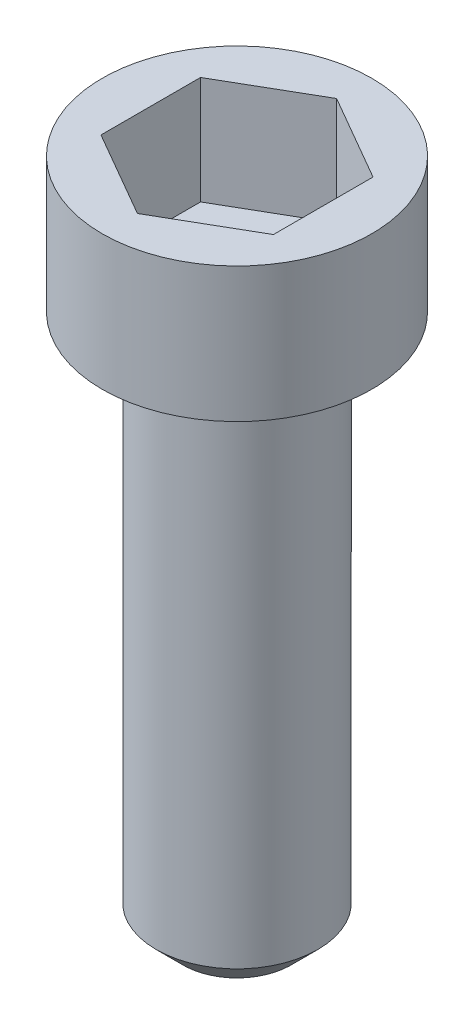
from build123d import *

# Parameters (mm, degrees)
ESQUISSE1_R             = 2.5
EXTRUSION1_DEPTH        = 2.5
ENL_V_MAT_EXTRU_1_DEPTH = 2
ESQUISSE3_R             = 1.5
EXTRUSION2_DEPTH        = 10
CHANFREIN1_SIZE         = 0.5


with BuildPart() as part:
    # Esquisse1 → Extrusion1 (new body)
    with BuildSketch(Plane(origin=(0, 0, 0), x_dir=(1, 0, 0), z_dir=(0, 1, 0))):
        with Locations(Location((0, 0, 0), (0, 0, 270))):
            Circle(ESQUISSE1_R)
    extrude(amount=EXTRUSION1_DEPTH)

    # Esquisse2 → Enl_v. mat.-Extru.1 (cut)
    with BuildSketch(Plane(origin=(0, 2.5, 0), x_dir=(-1, 0, 0), z_dir=(0, 1, 0))):
        Polygon((0, 1.847520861), (-1.6, 0.923760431), (-1.6, -0.923760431), (0, -1.847520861), (1.6, -0.923760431), (1.6, 0.923760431), align=None)
    extrude(amount=-ENL_V_MAT_EXTRU_1_DEPTH, mode=Mode.SUBTRACT)

    # Esquisse3 → Extrusion2 (add)
    with BuildSketch(Plane.XZ):
        with Locations(Location((0, 0, 0), (0, 0, 90))):
            Circle(ESQUISSE3_R)
    extrude(amount=EXTRUSION2_DEPTH)

    # Chanfrein1
    chanfrein1_edges = [part.edges().sort_by_distance(p)[0] for p in [
        (0, -10, -1.5),
    ]]
    chamfer(chanfrein1_edges, length=CHANFREIN1_SIZE)


solid = part.part
